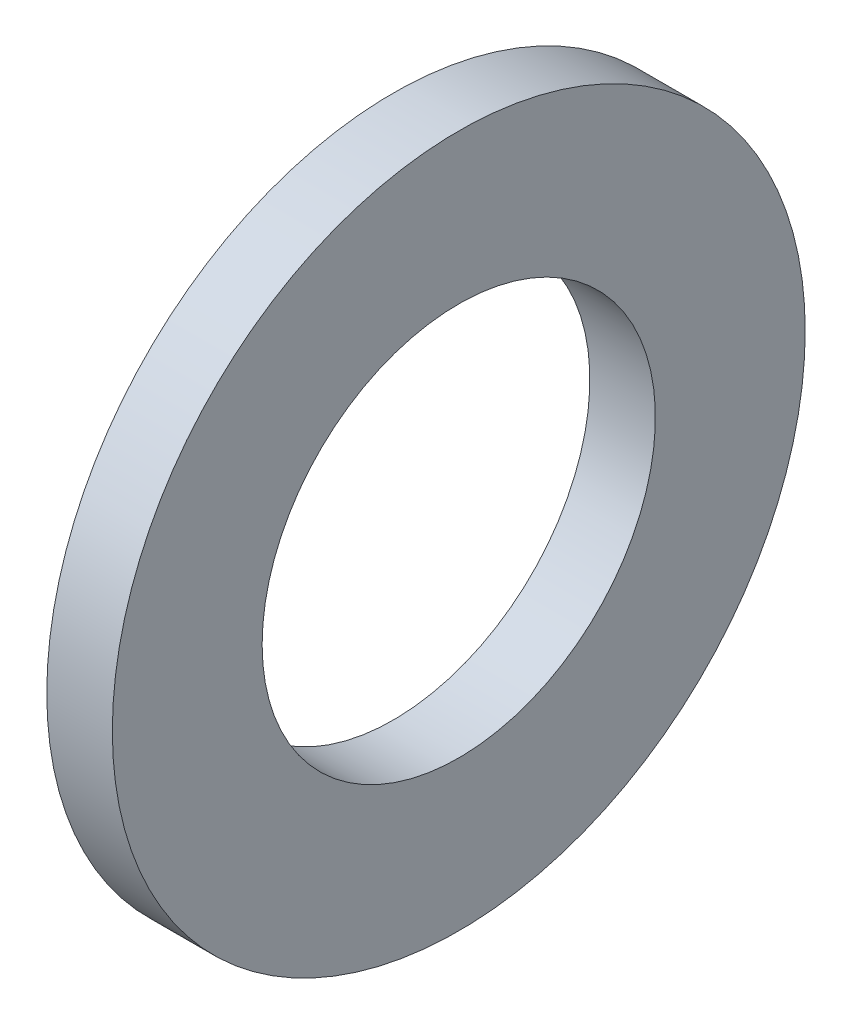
from build123d import *

# Parameters (mm, degrees)
SKETCH1_W = 3.5
SKETCH1_H = 8


with BuildPart() as part:
    # Sketch1 → Base-Revolve (revolve)
    with BuildSketch(Plane.XY, mode=Mode.PRIVATE) as base_revolve_sk:
        with Locations((-1.75, 14.5)):
            Rectangle(SKETCH1_W, SKETCH1_H)
    revolve(base_revolve_sk.sketch.rotate(Axis((-34.925, 0, 0), (1, 0, 0)), 90), axis=Axis((-34.925, 0, 0), (1, 0, 0)))


solid = part.part
